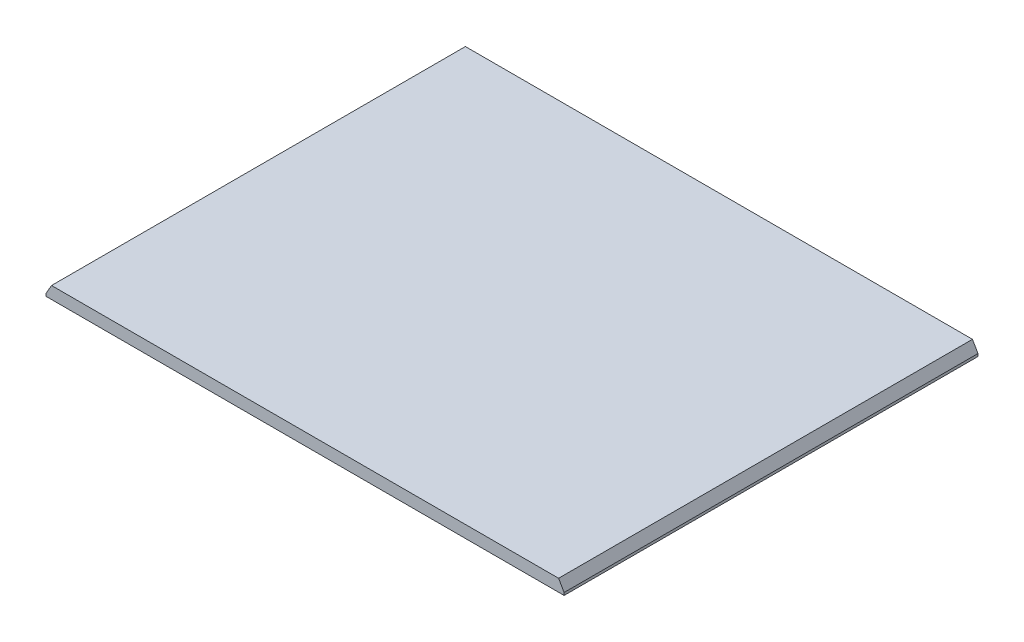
ISO-10303-21;
HEADER;
FILE_DESCRIPTION(('STEP AP214'),'2;1');
FILE_NAME('part.step','',(''),(''),'','','');
FILE_SCHEMA(('AUTOMOTIVE_DESIGN { 1 0 10303 214 1 1 1 1 }'));
ENDSEC;
DATA;
#1=APPLICATION_CONTEXT('core data for automotive mechanical design processes');
#2=APPLICATION_PROTOCOL_DEFINITION('international standard','automotive_design',2000,#1);
#3=PRODUCT_CONTEXT('',#1,'mechanical');
#4=PRODUCT('Part','Part','',(#3));
#5=PRODUCT_RELATED_PRODUCT_CATEGORY('part','',(#4));
#6=PRODUCT_DEFINITION_FORMATION('','',#4);
#7=PRODUCT_DEFINITION_CONTEXT('part definition',#1,'design');
#8=PRODUCT_DEFINITION('design','',#6,#7);
#9=PRODUCT_DEFINITION_SHAPE('','',#8);
#10=(LENGTH_UNIT() NAMED_UNIT(*) SI_UNIT(.MILLI.,.METRE.));
#11=(NAMED_UNIT(*) PLANE_ANGLE_UNIT() SI_UNIT($,.RADIAN.));
#12=(NAMED_UNIT(*) SI_UNIT($,.STERADIAN.) SOLID_ANGLE_UNIT());
#13=UNCERTAINTY_MEASURE_WITH_UNIT(LENGTH_MEASURE(1.E-05),#10,'distance_accuracy_value','');
#14=(GEOMETRIC_REPRESENTATION_CONTEXT(3) GLOBAL_UNCERTAINTY_ASSIGNED_CONTEXT((#13)) GLOBAL_UNIT_ASSIGNED_CONTEXT((#10,
#11,#12)) REPRESENTATION_CONTEXT('',''));
#15=CARTESIAN_POINT('',(0.,0.,0.));
#16=DIRECTION('',(0.,0.,1.));
#17=DIRECTION('',(1.,0.,0.));
#18=AXIS2_PLACEMENT_3D('',#15,#16,#17);
#19=CARTESIAN_POINT('',(541.5415,25.4,432.6));
#20=DIRECTION('',(-1.,0.,0.));
#21=DIRECTION('',(0.,0.,1.));
#22=AXIS2_PLACEMENT_3D('',#19,#20,#21);
#23=PLANE('',#22);
#24=DIRECTION('',(0.,-1.,0.));
#25=VECTOR('',#24,1.);
#26=CARTESIAN_POINT('',(541.5415,25.4,-432.6));
#27=LINE('',#26,#25);
#28=CARTESIAN_POINT('',(541.5415,5.39999999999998,-432.6));
#29=VERTEX_POINT('',#28);
#30=CARTESIAN_POINT('',(541.5415,0.,-432.6));
#31=VERTEX_POINT('',#30);
#32=EDGE_CURVE('E96',#29,#31,#27,.T.);
#33=ORIENTED_EDGE('',*,*,#32,.F.);
#34=DIRECTION('',(0.,0.,1.));
#35=VECTOR('',#34,1.);
#36=CARTESIAN_POINT('',(541.5415,5.39999999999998,432.6));
#37=LINE('',#36,#35);
#38=CARTESIAN_POINT('',(541.5415,5.39999999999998,432.6));
#39=VERTEX_POINT('',#38);
#40=EDGE_CURVE('E11',#29,#39,#37,.T.);
#41=ORIENTED_EDGE('',*,*,#40,.T.);
#42=DIRECTION('',(0.,-1.,0.));
#43=VECTOR('',#42,1.);
#44=CARTESIAN_POINT('',(541.5415,25.4,432.6));
#45=LINE('',#44,#43);
#46=CARTESIAN_POINT('',(541.5415,0.,432.6));
#47=VERTEX_POINT('',#46);
#48=EDGE_CURVE('E119',#39,#47,#45,.T.);
#49=ORIENTED_EDGE('',*,*,#48,.T.);
#50=DIRECTION('',(0.,0.,-1.));
#51=VECTOR('',#50,1.);
#52=CARTESIAN_POINT('',(541.5415,0.,432.6));
#53=LINE('',#52,#51);
#54=EDGE_CURVE('E112',#47,#31,#53,.T.);
#55=ORIENTED_EDGE('',*,*,#54,.T.);
#56=EDGE_LOOP('',(#33,#41,#49,#55));
#57=FACE_BOUND('',#56,.T.);
#58=ADVANCED_FACE('F44',(#57),#23,.F.);
#59=CARTESIAN_POINT('',(541.5415,25.4,-432.6));
#60=DIRECTION('',(0.,0.,1.));
#61=DIRECTION('',(1.,0.,0.));
#62=AXIS2_PLACEMENT_3D('',#59,#60,#61);
#63=PLANE('',#62);
#64=DIRECTION('',(0.,-1.,0.));
#65=VECTOR('',#64,1.);
#66=CARTESIAN_POINT('',(-541.5415,25.4,-432.6));
#67=LINE('',#66,#65);
#68=CARTESIAN_POINT('',(-541.5415,5.39999999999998,-432.6));
#69=VERTEX_POINT('',#68);
#70=CARTESIAN_POINT('',(-541.5415,0.,-432.6));
#71=VERTEX_POINT('',#70);
#72=EDGE_CURVE('E108',#69,#71,#67,.T.);
#73=ORIENTED_EDGE('',*,*,#72,.F.);
#74=DIRECTION('',(0.499999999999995,0.866025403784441,0.));
#75=VECTOR('',#74,1.);
#76=CARTESIAN_POINT('',(-529.994494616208,25.4,-432.6));
#77=LINE('',#76,#75);
#78=CARTESIAN_POINT('',(-529.994494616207,25.4,-432.6));
#79=VERTEX_POINT('',#78);
#80=EDGE_CURVE('E54',#69,#79,#77,.T.);
#81=ORIENTED_EDGE('',*,*,#80,.T.);
#82=DIRECTION('',(-1.,0.,0.));
#83=VECTOR('',#82,1.);
#84=CARTESIAN_POINT('',(541.5415,25.4,-432.6));
#85=LINE('',#84,#83);
#86=CARTESIAN_POINT('',(529.994494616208,25.4,-432.6));
#87=VERTEX_POINT('',#86);
#88=EDGE_CURVE('E131',#87,#79,#85,.T.);
#89=ORIENTED_EDGE('',*,*,#88,.F.);
#90=DIRECTION('',(0.499999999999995,-0.866025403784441,0.));
#91=VECTOR('',#90,1.);
#92=CARTESIAN_POINT('',(529.994494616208,25.4,-432.6));
#93=LINE('',#92,#91);
#94=EDGE_CURVE('E65',#87,#29,#93,.T.);
#95=ORIENTED_EDGE('',*,*,#94,.T.);
#96=ORIENTED_EDGE('',*,*,#32,.T.);
#97=DIRECTION('',(-1.,0.,0.));
#98=VECTOR('',#97,1.);
#99=CARTESIAN_POINT('',(541.5415,0.,-432.6));
#100=LINE('',#99,#98);
#101=EDGE_CURVE('E103',#31,#71,#100,.T.);
#102=ORIENTED_EDGE('',*,*,#101,.T.);
#103=EDGE_LOOP('',(#73,#81,#89,#95,#96,#102));
#104=FACE_BOUND('',#103,.T.);
#105=ADVANCED_FACE('F99',(#104),#63,.F.);
#106=CARTESIAN_POINT('',(-541.5415,25.4,432.6));
#107=DIRECTION('',(1.,0.,0.));
#108=DIRECTION('',(0.,0.,-1.));
#109=AXIS2_PLACEMENT_3D('',#106,#107,#108);
#110=PLANE('',#109);
#111=DIRECTION('',(0.,-1.,0.));
#112=VECTOR('',#111,1.);
#113=CARTESIAN_POINT('',(-541.5415,25.4,432.6));
#114=LINE('',#113,#112);
#115=CARTESIAN_POINT('',(-541.5415,5.39999999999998,432.6));
#116=VERTEX_POINT('',#115);
#117=CARTESIAN_POINT('',(-541.5415,0.,432.6));
#118=VERTEX_POINT('',#117);
#119=EDGE_CURVE('E140',#116,#118,#114,.T.);
#120=ORIENTED_EDGE('',*,*,#119,.F.);
#121=DIRECTION('',(0.,0.,-1.));
#122=VECTOR('',#121,1.);
#123=CARTESIAN_POINT('',(-541.5415,5.39999999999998,-432.6));
#124=LINE('',#123,#122);
#125=EDGE_CURVE('E68',#116,#69,#124,.T.);
#126=ORIENTED_EDGE('',*,*,#125,.T.);
#127=ORIENTED_EDGE('',*,*,#72,.T.);
#128=DIRECTION('',(0.,0.,1.));
#129=VECTOR('',#128,1.);
#130=CARTESIAN_POINT('',(-541.5415,0.,432.6));
#131=LINE('',#130,#129);
#132=EDGE_CURVE('E116',#71,#118,#131,.T.);
#133=ORIENTED_EDGE('',*,*,#132,.T.);
#134=EDGE_LOOP('',(#120,#126,#127,#133));
#135=FACE_BOUND('',#134,.T.);
#136=ADVANCED_FACE('F173',(#135),#110,.F.);
#137=CARTESIAN_POINT('',(541.5415,25.4,432.6));
#138=DIRECTION('',(0.,0.,-1.));
#139=DIRECTION('',(-1.,0.,0.));
#140=AXIS2_PLACEMENT_3D('',#137,#138,#139);
#141=PLANE('',#140);
#142=DIRECTION('',(1.,0.,0.));
#143=VECTOR('',#142,1.);
#144=CARTESIAN_POINT('',(541.5415,25.4,432.6));
#145=LINE('',#144,#143);
#146=CARTESIAN_POINT('',(-529.994494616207,25.4,432.6));
#147=VERTEX_POINT('',#146);
#148=CARTESIAN_POINT('',(529.994494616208,25.4,432.6));
#149=VERTEX_POINT('',#148);
#150=EDGE_CURVE('E127',#147,#149,#145,.T.);
#151=ORIENTED_EDGE('',*,*,#150,.F.);
#152=DIRECTION('',(-0.499999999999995,-0.866025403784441,0.));
#153=VECTOR('',#152,1.);
#154=CARTESIAN_POINT('',(-529.994494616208,25.4,432.6));
#155=LINE('',#154,#153);
#156=EDGE_CURVE('E155',#147,#116,#155,.T.);
#157=ORIENTED_EDGE('',*,*,#156,.T.);
#158=ORIENTED_EDGE('',*,*,#119,.T.);
#159=DIRECTION('',(1.,0.,0.));
#160=VECTOR('',#159,1.);
#161=CARTESIAN_POINT('',(541.5415,0.,432.6));
#162=LINE('',#161,#160);
#163=EDGE_CURVE('E132',#118,#47,#162,.T.);
#164=ORIENTED_EDGE('',*,*,#163,.T.);
#165=ORIENTED_EDGE('',*,*,#48,.F.);
#166=DIRECTION('',(-0.499999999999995,0.866025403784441,0.));
#167=VECTOR('',#166,1.);
#168=CARTESIAN_POINT('',(529.994494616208,25.4,432.6));
#169=LINE('',#168,#167);
#170=EDGE_CURVE('E146',#39,#149,#169,.T.);
#171=ORIENTED_EDGE('',*,*,#170,.T.);
#172=EDGE_LOOP('',(#151,#157,#158,#164,#165,#171));
#173=FACE_BOUND('',#172,.T.);
#174=ADVANCED_FACE('F175',(#173),#141,.F.);
#175=CARTESIAN_POINT('',(0.,25.4,0.));
#176=DIRECTION('',(0.,1.,0.));
#177=DIRECTION('',(0.,0.,1.));
#178=AXIS2_PLACEMENT_3D('',#175,#176,#177);
#179=PLANE('',#178);
#180=ORIENTED_EDGE('',*,*,#88,.T.);
#181=DIRECTION('',(0.,0.,1.));
#182=VECTOR('',#181,1.);
#183=CARTESIAN_POINT('',(-529.994494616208,25.4,432.6));
#184=LINE('',#183,#182);
#185=EDGE_CURVE('E143',#79,#147,#184,.T.);
#186=ORIENTED_EDGE('',*,*,#185,.T.);
#187=ORIENTED_EDGE('',*,*,#150,.T.);
#188=DIRECTION('',(0.,0.,-1.));
#189=VECTOR('',#188,1.);
#190=CARTESIAN_POINT('',(529.994494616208,25.4,-432.6));
#191=LINE('',#190,#189);
#192=EDGE_CURVE('E110',#149,#87,#191,.T.);
#193=ORIENTED_EDGE('',*,*,#192,.T.);
#194=EDGE_LOOP('',(#180,#186,#187,#193));
#195=FACE_BOUND('',#194,.T.);
#196=ADVANCED_FACE('F164',(#195),#179,.T.);
#197=CARTESIAN_POINT('',(0.,0.,0.));
#198=DIRECTION('',(0.,1.,0.));
#199=DIRECTION('',(0.,0.,1.));
#200=AXIS2_PLACEMENT_3D('',#197,#198,#199);
#201=PLANE('',#200);
#202=ORIENTED_EDGE('',*,*,#54,.F.);
#203=ORIENTED_EDGE('',*,*,#163,.F.);
#204=ORIENTED_EDGE('',*,*,#132,.F.);
#205=ORIENTED_EDGE('',*,*,#101,.F.);
#206=EDGE_LOOP('',(#202,#203,#204,#205));
#207=FACE_BOUND('',#206,.T.);
#208=ADVANCED_FACE('F115',(#207),#201,.F.);
#209=CARTESIAN_POINT('',(-529.994494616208,25.4,0.));
#210=DIRECTION('',(-0.866025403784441,0.499999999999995,0.));
#211=DIRECTION('',(0.,0.,-1.));
#212=AXIS2_PLACEMENT_3D('',#209,#210,#211);
#213=PLANE('',#212);
#214=ORIENTED_EDGE('',*,*,#80,.F.);
#215=ORIENTED_EDGE('',*,*,#125,.F.);
#216=ORIENTED_EDGE('',*,*,#156,.F.);
#217=ORIENTED_EDGE('',*,*,#185,.F.);
#218=EDGE_LOOP('',(#214,#215,#216,#217));
#219=FACE_BOUND('',#218,.T.);
#220=ADVANCED_FACE('F167',(#219),#213,.T.);
#221=CARTESIAN_POINT('',(529.994494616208,25.4,0.));
#222=DIRECTION('',(0.866025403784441,0.499999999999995,0.));
#223=DIRECTION('',(0.,0.,1.));
#224=AXIS2_PLACEMENT_3D('',#221,#222,#223);
#225=PLANE('',#224);
#226=ORIENTED_EDGE('',*,*,#170,.F.);
#227=ORIENTED_EDGE('',*,*,#40,.F.);
#228=ORIENTED_EDGE('',*,*,#94,.F.);
#229=ORIENTED_EDGE('',*,*,#192,.F.);
#230=EDGE_LOOP('',(#226,#227,#228,#229));
#231=FACE_BOUND('',#230,.T.);
#232=ADVANCED_FACE('F48',(#231),#225,.T.);
#233=CLOSED_SHELL('',(#58,#105,#136,#174,#196,#208,#220,#232));
#234=MANIFOLD_SOLID_BREP('B2',#233);
#235=ADVANCED_BREP_SHAPE_REPRESENTATION('',(#18,#234),#14);
#236=SHAPE_DEFINITION_REPRESENTATION(#9,#235);
ENDSEC;
END-ISO-10303-21;
